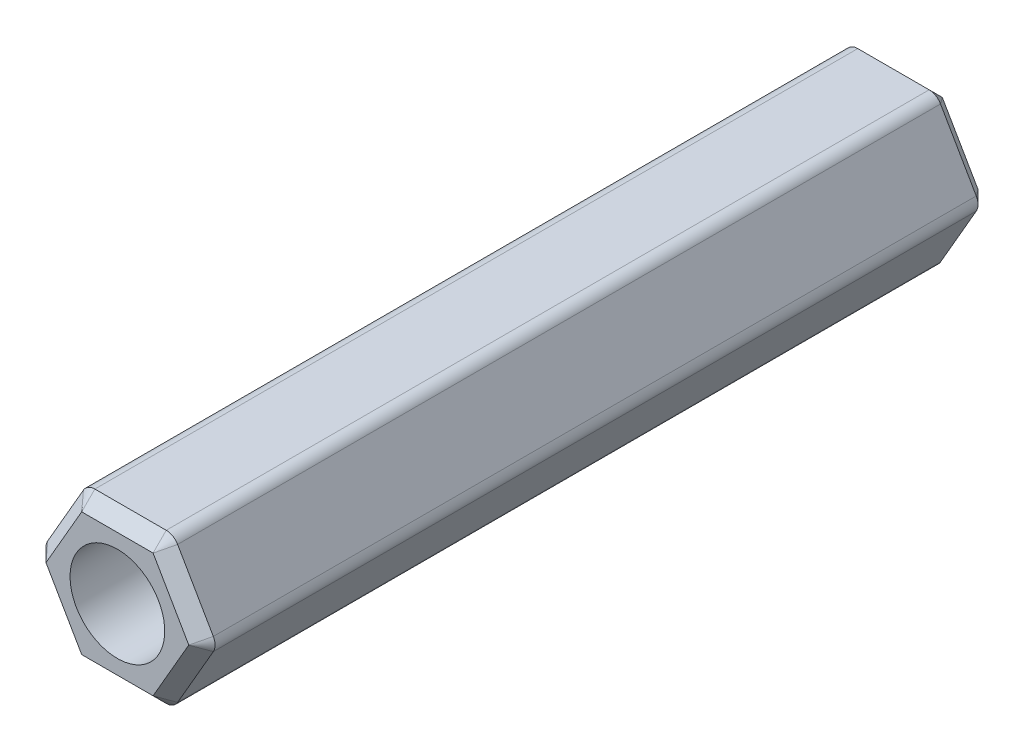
ISO-10303-21;
HEADER;
FILE_DESCRIPTION(('STEP AP214'),'2;1');
FILE_NAME('part.step','',(''),(''),'','','');
FILE_SCHEMA(('AUTOMOTIVE_DESIGN { 1 0 10303 214 1 1 1 1 }'));
ENDSEC;
DATA;
#1=APPLICATION_CONTEXT('core data for automotive mechanical design processes');
#2=APPLICATION_PROTOCOL_DEFINITION('international standard','automotive_design',2000,#1);
#3=PRODUCT_CONTEXT('',#1,'mechanical');
#4=PRODUCT('Part','Part','',(#3));
#5=PRODUCT_RELATED_PRODUCT_CATEGORY('part','',(#4));
#6=PRODUCT_DEFINITION_FORMATION('','',#4);
#7=PRODUCT_DEFINITION_CONTEXT('part definition',#1,'design');
#8=PRODUCT_DEFINITION('design','',#6,#7);
#9=PRODUCT_DEFINITION_SHAPE('','',#8);
#10=(LENGTH_UNIT() NAMED_UNIT(*) SI_UNIT(.MILLI.,.METRE.));
#11=(NAMED_UNIT(*) PLANE_ANGLE_UNIT() SI_UNIT($,.RADIAN.));
#12=(NAMED_UNIT(*) SI_UNIT($,.STERADIAN.) SOLID_ANGLE_UNIT());
#13=UNCERTAINTY_MEASURE_WITH_UNIT(LENGTH_MEASURE(1.E-05),#10,'distance_accuracy_value','');
#14=(GEOMETRIC_REPRESENTATION_CONTEXT(3) GLOBAL_UNCERTAINTY_ASSIGNED_CONTEXT((#13)) GLOBAL_UNIT_ASSIGNED_CONTEXT((#10,
#11,#12)) REPRESENTATION_CONTEXT('',''));
#15=CARTESIAN_POINT('',(0.,0.,0.));
#16=DIRECTION('',(0.,0.,1.));
#17=DIRECTION('',(1.,0.,0.));
#18=AXIS2_PLACEMENT_3D('',#15,#16,#17);
#19=CARTESIAN_POINT('',(1.3567731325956,-2.34999999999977,15.));
#20=DIRECTION('',(0.,0.,-1.));
#21=DIRECTION('',(-1.,0.,0.));
#22=AXIS2_PLACEMENT_3D('',#19,#20,#21);
#23=CYLINDRICAL_SURFACE('',#22,0.499999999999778);
#24=DIRECTION('',(0.,0.,1.));
#25=VECTOR('',#24,1.);
#26=CARTESIAN_POINT('',(1.78978583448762,-2.59999999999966,15.));
#27=LINE('',#26,#25);
#28=CARTESIAN_POINT('',(1.78978583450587,-2.60000000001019,14.5000000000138));
#29=VERTEX_POINT('',#28);
#30=CARTESIAN_POINT('',(1.78978583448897,-2.60000000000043,-14.4999999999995));
#31=VERTEX_POINT('',#30);
#32=EDGE_CURVE('E212',#29,#31,#27,.F.);
#33=ORIENTED_EDGE('',*,*,#32,.F.);
#34=CARTESIAN_POINT('',(1.3567731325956,-2.34999999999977,14.5));
#35=DIRECTION('',(0.,0.,-1.));
#36=DIRECTION('',(-1.,0.,0.));
#37=AXIS2_PLACEMENT_3D('',#34,#35,#36);
#38=CIRCLE('',#37,0.499999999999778);
#39=CARTESIAN_POINT('',(1.3567731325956,-2.85000000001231,14.5000000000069));
#40=VERTEX_POINT('',#39);
#41=EDGE_CURVE('E223',#29,#40,#38,.T.);
#42=ORIENTED_EDGE('',*,*,#41,.T.);
#43=DIRECTION('',(0.,0.,-1.));
#44=VECTOR('',#43,1.);
#45=CARTESIAN_POINT('',(1.3567731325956,-2.84999999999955,15.));
#46=LINE('',#45,#44);
#47=CARTESIAN_POINT('',(1.3567731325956,-2.85000000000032,-14.4999999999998));
#48=VERTEX_POINT('',#47);
#49=EDGE_CURVE('E205',#48,#40,#46,.F.);
#50=ORIENTED_EDGE('',*,*,#49,.F.);
#51=CARTESIAN_POINT('',(1.3567731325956,-2.34999999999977,-14.4999999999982));
#52=DIRECTION('',(0.,0.,1.));
#53=DIRECTION('',(1.,0.,0.));
#54=AXIS2_PLACEMENT_3D('',#51,#52,#53);
#55=CIRCLE('',#54,0.500000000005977);
#56=EDGE_CURVE('E214',#31,#48,#55,.F.);
#57=ORIENTED_EDGE('',*,*,#56,.F.);
#58=EDGE_LOOP('',(#33,#42,#50,#57));
#59=FACE_BOUND('',#58,.T.);
#60=ADVANCED_FACE('F18',(#59),#23,.T.);
#61=CARTESIAN_POINT('',(-1.3567731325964,-2.34999999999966,15.));
#62=DIRECTION('',(0.,0.,-1.));
#63=DIRECTION('',(-1.,0.,0.));
#64=AXIS2_PLACEMENT_3D('',#61,#62,#63);
#65=CYLINDRICAL_SURFACE('',#64,0.499999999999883);
#66=DIRECTION('',(0.,0.,-1.));
#67=VECTOR('',#66,1.);
#68=CARTESIAN_POINT('',(-1.3567731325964,-2.84999999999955,15.));
#69=LINE('',#68,#67);
#70=CARTESIAN_POINT('',(-1.35677313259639,-2.84999999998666,14.5000000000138));
#71=VERTEX_POINT('',#70);
#72=CARTESIAN_POINT('',(-1.3567731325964,-2.85000000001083,-14.4999999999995));
#73=VERTEX_POINT('',#72);
#74=EDGE_CURVE('E208',#71,#73,#69,.T.);
#75=ORIENTED_EDGE('',*,*,#74,.F.);
#76=CARTESIAN_POINT('',(-1.3567731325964,-2.34999999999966,14.500000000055));
#77=DIRECTION('',(0.,0.,-1.));
#78=DIRECTION('',(-1.,0.,0.));
#79=AXIS2_PLACEMENT_3D('',#76,#77,#78);
#80=CIRCLE('',#79,0.499999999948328);
#81=CARTESIAN_POINT('',(-1.78978583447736,-2.59999999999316,14.5000000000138));
#82=VERTEX_POINT('',#81);
#83=EDGE_CURVE('E168',#82,#71,#80,.F.);
#84=ORIENTED_EDGE('',*,*,#83,.F.);
#85=DIRECTION('',(0.,0.,1.));
#86=VECTOR('',#85,1.);
#87=CARTESIAN_POINT('',(-1.78978583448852,-2.5999999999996,15.));
#88=LINE('',#87,#86);
#89=CARTESIAN_POINT('',(-1.78978583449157,-2.60000000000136,-14.4999999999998));
#90=VERTEX_POINT('',#89);
#91=EDGE_CURVE('E167',#90,#82,#88,.T.);
#92=ORIENTED_EDGE('',*,*,#91,.F.);
#93=CARTESIAN_POINT('',(-1.3567731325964,-2.34999999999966,-14.4999999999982));
#94=DIRECTION('',(0.,0.,1.));
#95=DIRECTION('',(1.,0.,0.));
#96=AXIS2_PLACEMENT_3D('',#93,#94,#95);
#97=CIRCLE('',#96,0.500000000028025);
#98=EDGE_CURVE('E140',#73,#90,#97,.F.);
#99=ORIENTED_EDGE('',*,*,#98,.F.);
#100=EDGE_LOOP('',(#75,#84,#92,#99));
#101=FACE_BOUND('',#100,.T.);
#102=ADVANCED_FACE('F720',(#101),#65,.T.);
#103=CARTESIAN_POINT('',(-2.71354626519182,1.01649243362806E-13,15.));
#104=DIRECTION('',(0.,0.,-1.));
#105=DIRECTION('',(-1.,0.,0.));
#106=AXIS2_PLACEMENT_3D('',#103,#104,#105);
#107=CYLINDRICAL_SURFACE('',#106,0.499999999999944);
#108=DIRECTION('',(0.,0.,1.));
#109=VECTOR('',#108,1.);
#110=CARTESIAN_POINT('',(-3.14655896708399,0.250000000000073,15.));
#111=LINE('',#110,#109);
#112=CARTESIAN_POINT('',(-3.14655896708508,0.250000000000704,-14.4999999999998));
#113=VERTEX_POINT('',#112);
#114=CARTESIAN_POINT('',(-3.14655896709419,0.249999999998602,14.5000000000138));
#115=VERTEX_POINT('',#114);
#116=EDGE_CURVE('E152',#113,#115,#111,.T.);
#117=ORIENTED_EDGE('',*,*,#116,.F.);
#118=CARTESIAN_POINT('',(-2.71354626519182,1.01649243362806E-13,-14.4999999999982));
#119=DIRECTION('',(0.,0.,1.));
#120=DIRECTION('',(1.,0.,0.));
#121=AXIS2_PLACEMENT_3D('',#118,#119,#120);
#122=CIRCLE('',#121,0.500000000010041);
#123=CARTESIAN_POINT('',(-3.1465589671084,-0.249999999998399,-14.4999999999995));
#124=VERTEX_POINT('',#123);
#125=EDGE_CURVE('E146',#124,#113,#122,.F.);
#126=ORIENTED_EDGE('',*,*,#125,.F.);
#127=DIRECTION('',(0.,0.,1.));
#128=VECTOR('',#127,1.);
#129=CARTESIAN_POINT('',(-3.14655896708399,-0.24999999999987,15.));
#130=LINE('',#129,#128);
#131=CARTESIAN_POINT('',(-3.14655896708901,-0.250000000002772,14.5000000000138));
#132=VERTEX_POINT('',#131);
#133=EDGE_CURVE('E150',#132,#124,#130,.F.);
#134=ORIENTED_EDGE('',*,*,#133,.F.);
#135=CARTESIAN_POINT('',(-2.71354626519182,1.01649243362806E-13,14.500000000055));
#136=DIRECTION('',(0.,0.,-1.));
#137=DIRECTION('',(-1.,0.,0.));
#138=AXIS2_PLACEMENT_3D('',#135,#136,#137);
#139=CIRCLE('',#138,0.500000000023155);
#140=EDGE_CURVE('E201',#115,#132,#139,.F.);
#141=ORIENTED_EDGE('',*,*,#140,.F.);
#142=EDGE_LOOP('',(#117,#126,#134,#141));
#143=FACE_BOUND('',#142,.T.);
#144=ADVANCED_FACE('F148',(#143),#107,.T.);
#145=CARTESIAN_POINT('',(-1.35677313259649,2.34999999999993,15.));
#146=DIRECTION('',(0.,0.,-1.));
#147=DIRECTION('',(-1.,0.,0.));
#148=AXIS2_PLACEMENT_3D('',#145,#146,#147);
#149=CYLINDRICAL_SURFACE('',#148,0.499999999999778);
#150=DIRECTION('',(0.,0.,1.));
#151=VECTOR('',#150,1.);
#152=CARTESIAN_POINT('',(-1.78978583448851,2.59999999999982,15.));
#153=LINE('',#152,#151);
#154=CARTESIAN_POINT('',(-1.78978583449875,2.60000000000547,14.4999999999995));
#155=VERTEX_POINT('',#154);
#156=CARTESIAN_POINT('',(-1.78978583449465,2.60000000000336,-14.4999999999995));
#157=VERTEX_POINT('',#156);
#158=EDGE_CURVE('E199',#155,#157,#153,.F.);
#159=ORIENTED_EDGE('',*,*,#158,.F.);
#160=CARTESIAN_POINT('',(-1.35677313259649,2.34999999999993,14.4999999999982));
#161=DIRECTION('',(0.,0.,-1.));
#162=DIRECTION('',(-1.,0.,0.));
#163=AXIS2_PLACEMENT_3D('',#160,#161,#162);
#164=CIRCLE('',#163,0.50000000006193);
#165=CARTESIAN_POINT('',(-1.35677313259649,2.85000000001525,14.4999999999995));
#166=VERTEX_POINT('',#165);
#167=EDGE_CURVE('E196',#166,#155,#164,.F.);
#168=ORIENTED_EDGE('',*,*,#167,.F.);
#169=DIRECTION('',(0.,0.,1.));
#170=VECTOR('',#169,1.);
#171=CARTESIAN_POINT('',(-1.35677313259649,2.84999999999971,15.));
#172=LINE('',#171,#170);
#173=CARTESIAN_POINT('',(-1.35677313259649,2.85000000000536,-14.4999999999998));
#174=VERTEX_POINT('',#173);
#175=EDGE_CURVE('E192',#174,#166,#172,.T.);
#176=ORIENTED_EDGE('',*,*,#175,.F.);
#177=CARTESIAN_POINT('',(-1.35677313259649,2.34999999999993,-14.4999999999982));
#178=DIRECTION('',(0.,0.,1.));
#179=DIRECTION('',(1.,0.,0.));
#180=AXIS2_PLACEMENT_3D('',#177,#178,#179);
#181=CIRCLE('',#180,0.50000000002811);
#182=EDGE_CURVE('E157',#157,#174,#181,.F.);
#183=ORIENTED_EDGE('',*,*,#182,.F.);
#184=EDGE_LOOP('',(#159,#168,#176,#183));
#185=FACE_BOUND('',#184,.T.);
#186=ADVANCED_FACE('F703',(#185),#149,.T.);
#187=CARTESIAN_POINT('',(2.71354626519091,0.,15.));
#188=DIRECTION('',(0.,0.,-1.));
#189=DIRECTION('',(-1.,0.,0.));
#190=AXIS2_PLACEMENT_3D('',#187,#188,#189);
#191=CYLINDRICAL_SURFACE('',#190,0.499999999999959);
#192=DIRECTION('',(0.,0.,1.));
#193=VECTOR('',#192,1.);
#194=CARTESIAN_POINT('',(3.14655896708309,0.250000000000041,15.));
#195=LINE('',#194,#193);
#196=CARTESIAN_POINT('',(3.14655896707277,0.249999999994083,14.5000000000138));
#197=VERTEX_POINT('',#196);
#198=CARTESIAN_POINT('',(3.1465589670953,0.250000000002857,-14.4999999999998));
#199=VERTEX_POINT('',#198);
#200=EDGE_CURVE('E184',#197,#199,#195,.F.);
#201=ORIENTED_EDGE('',*,*,#200,.F.);
#202=CARTESIAN_POINT('',(2.71354626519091,0.,14.500000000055));
#203=DIRECTION('',(0.,0.,-1.));
#204=DIRECTION('',(-1.,0.,0.));
#205=AXIS2_PLACEMENT_3D('',#202,#203,#204);
#206=CIRCLE('',#205,0.499999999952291);
#207=CARTESIAN_POINT('',(3.14655896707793,-0.249999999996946,14.5000000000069));
#208=VERTEX_POINT('',#207);
#209=EDGE_CURVE('E190',#208,#197,#206,.F.);
#210=ORIENTED_EDGE('',*,*,#209,.F.);
#211=DIRECTION('',(0.,0.,1.));
#212=VECTOR('',#211,1.);
#213=CARTESIAN_POINT('',(3.14655896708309,-0.249999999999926,15.));
#214=LINE('',#213,#212);
#215=CARTESIAN_POINT('',(3.14655896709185,-0.250000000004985,-14.4999999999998));
#216=VERTEX_POINT('',#215);
#217=EDGE_CURVE('E210',#216,#208,#214,.T.);
#218=ORIENTED_EDGE('',*,*,#217,.F.);
#219=CARTESIAN_POINT('',(2.71354626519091,0.,-14.4999999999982));
#220=DIRECTION('',(0.,0.,1.));
#221=DIRECTION('',(1.,0.,0.));
#222=AXIS2_PLACEMENT_3D('',#219,#220,#221);
#223=CIRCLE('',#222,0.500000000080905);
#224=EDGE_CURVE('E217',#199,#216,#223,.F.);
#225=ORIENTED_EDGE('',*,*,#224,.F.);
#226=EDGE_LOOP('',(#201,#210,#218,#225));
#227=FACE_BOUND('',#226,.T.);
#228=ADVANCED_FACE('F694',(#227),#191,.T.);
#229=CARTESIAN_POINT('',(1.35677313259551,2.34999999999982,15.));
#230=DIRECTION('',(0.,0.,-1.));
#231=DIRECTION('',(-1.,0.,0.));
#232=AXIS2_PLACEMENT_3D('',#229,#230,#231);
#233=CYLINDRICAL_SURFACE('',#232,0.499999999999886);
#234=DIRECTION('',(0.,0.,1.));
#235=VECTOR('',#234,1.);
#236=CARTESIAN_POINT('',(1.35677313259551,2.84999999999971,15.));
#237=LINE('',#236,#235);
#238=CARTESIAN_POINT('',(1.3567731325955,2.85000000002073,14.5000000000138));
#239=VERTEX_POINT('',#238);
#240=CARTESIAN_POINT('',(1.35677313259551,2.85000000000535,-14.4999999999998));
#241=VERTEX_POINT('',#240);
#242=EDGE_CURVE('E194',#239,#241,#237,.F.);
#243=ORIENTED_EDGE('',*,*,#242,.F.);
#244=CARTESIAN_POINT('',(1.35677313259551,2.34999999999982,14.5));
#245=DIRECTION('',(0.,0.,-1.));
#246=DIRECTION('',(-1.,0.,0.));
#247=AXIS2_PLACEMENT_3D('',#244,#245,#246);
#248=CIRCLE('',#247,0.499999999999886);
#249=CARTESIAN_POINT('',(1.78978583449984,2.60000000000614,14.5000000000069));
#250=VERTEX_POINT('',#249);
#251=EDGE_CURVE('E158',#239,#250,#248,.T.);
#252=ORIENTED_EDGE('',*,*,#251,.T.);
#253=DIRECTION('',(0.,0.,1.));
#254=VECTOR('',#253,1.);
#255=CARTESIAN_POINT('',(1.78978583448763,2.59999999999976,15.));
#256=LINE('',#255,#254);
#257=CARTESIAN_POINT('',(1.7897858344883,2.60000000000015,-14.4999999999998));
#258=VERTEX_POINT('',#257);
#259=EDGE_CURVE('E181',#258,#250,#256,.T.);
#260=ORIENTED_EDGE('',*,*,#259,.F.);
#261=CARTESIAN_POINT('',(1.35677313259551,2.34999999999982,-14.4999999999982));
#262=DIRECTION('',(0.,0.,1.));
#263=DIRECTION('',(1.,0.,0.));
#264=AXIS2_PLACEMENT_3D('',#261,#262,#263);
#265=CIRCLE('',#264,0.500000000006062);
#266=EDGE_CURVE('E219',#241,#258,#265,.F.);
#267=ORIENTED_EDGE('',*,*,#266,.F.);
#268=EDGE_LOOP('',(#243,#252,#260,#267));
#269=FACE_BOUND('',#268,.T.);
#270=ADVANCED_FACE('F686',(#269),#233,.T.);
#271=CARTESIAN_POINT('',(-2.71354626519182,1.01649243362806E-13,-14.4999999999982));
#272=DIRECTION('',(0.,0.,1.));
#273=DIRECTION('',(0.,-1.,0.));
#274=AXIS2_PLACEMENT_3D('',#271,#272,#273);
#275=CONICAL_SURFACE('',#274,0.500000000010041,0.785398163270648);
#276=ORIENTED_EDGE('',*,*,#125,.T.);
#277=DIRECTION('',(0.612372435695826,-0.353553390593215,-0.707106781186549));
#278=VECTOR('',#277,1.);
#279=CARTESIAN_POINT('',(-3.14655896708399,0.250000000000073,-14.5));
#280=LINE('',#279,#278);
#281=CARTESIAN_POINT('',(-2.71354626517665,8.85888607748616E-12,-15.00000000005));
#282=VERTEX_POINT('',#281);
#283=EDGE_CURVE('E179',#113,#282,#280,.T.);
#284=ORIENTED_EDGE('',*,*,#283,.T.);
#285=DIRECTION('',(-0.612372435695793,-0.353553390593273,0.707106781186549));
#286=VECTOR('',#285,1.);
#287=CARTESIAN_POINT('',(-2.71354626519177,1.28586377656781E-13,-15.));
#288=LINE('',#287,#286);
#289=EDGE_CURVE('E174',#282,#124,#288,.T.);
#290=ORIENTED_EDGE('',*,*,#289,.T.);
#291=EDGE_LOOP('',(#276,#284,#290));
#292=FACE_BOUND('',#291,.T.);
#293=ADVANCED_FACE('F178',(#292),#275,.T.);
#294=CARTESIAN_POINT('',(-1.35677313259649,2.34999999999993,-14.4999999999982));
#295=DIRECTION('',(0.,0.,1.));
#296=DIRECTION('',(0.,-1.,0.));
#297=AXIS2_PLACEMENT_3D('',#294,#295,#296);
#298=CONICAL_SURFACE('',#297,0.50000000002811,0.785398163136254);
#299=DIRECTION('',(0.,-0.707106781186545,-0.70710678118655));
#300=VECTOR('',#299,1.);
#301=CARTESIAN_POINT('',(-1.35677313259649,2.34999999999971,-15.));
#302=LINE('',#301,#300);
#303=CARTESIAN_POINT('',(-1.35677313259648,2.34999999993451,-15.0000000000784));
#304=VERTEX_POINT('',#303);
#305=EDGE_CURVE('E294',#174,#304,#302,.T.);
#306=ORIENTED_EDGE('',*,*,#305,.T.);
#307=DIRECTION('',(-0.612372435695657,0.353553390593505,0.707106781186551));
#308=VECTOR('',#307,1.);
#309=CARTESIAN_POINT('',(-1.35677313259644,2.34999999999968,-14.9999999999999));
#310=LINE('',#309,#308);
#311=EDGE_CURVE('E304',#304,#157,#310,.T.);
#312=ORIENTED_EDGE('',*,*,#311,.T.);
#313=ORIENTED_EDGE('',*,*,#182,.T.);
#314=EDGE_LOOP('',(#306,#312,#313));
#315=FACE_BOUND('',#314,.T.);
#316=ADVANCED_FACE('F670',(#315),#298,.T.);
#317=CARTESIAN_POINT('',(1.35677313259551,2.34999999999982,-14.4999999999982));
#318=DIRECTION('',(0.,0.,1.));
#319=DIRECTION('',(0.,-1.,0.));
#320=AXIS2_PLACEMENT_3D('',#317,#318,#319);
#321=CONICAL_SURFACE('',#320,0.500000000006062,0.785398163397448);
#322=DIRECTION('',(-0.612372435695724,-0.35355339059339,-0.70710678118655));
#323=VECTOR('',#322,1.);
#324=CARTESIAN_POINT('',(1.78978583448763,2.59999999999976,-14.5));
#325=LINE('',#324,#323);
#326=CARTESIAN_POINT('',(1.35677313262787,2.35000000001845,-14.9999999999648));
#327=VERTEX_POINT('',#326);
#328=EDGE_CURVE('E285',#258,#327,#325,.T.);
#329=ORIENTED_EDGE('',*,*,#328,.T.);
#330=DIRECTION('',(0.,-0.707106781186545,-0.70710678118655));
#331=VECTOR('',#330,1.);
#332=CARTESIAN_POINT('',(1.35677313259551,2.34999999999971,-15.));
#333=LINE('',#332,#331);
#334=EDGE_CURVE('E291',#327,#241,#333,.F.);
#335=ORIENTED_EDGE('',*,*,#334,.T.);
#336=ORIENTED_EDGE('',*,*,#266,.T.);
#337=EDGE_LOOP('',(#329,#335,#336));
#338=FACE_BOUND('',#337,.T.);
#339=ADVANCED_FACE('F389',(#338),#321,.T.);
#340=CARTESIAN_POINT('',(2.71354626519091,0.,-14.4999999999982));
#341=DIRECTION('',(0.,0.,1.));
#342=DIRECTION('',(0.,-1.,0.));
#343=AXIS2_PLACEMENT_3D('',#340,#341,#342);
#344=CONICAL_SURFACE('',#343,0.500000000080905,0.785398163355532);
#345=DIRECTION('',(-0.61237243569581,0.353553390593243,-0.70710678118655));
#346=VECTOR('',#345,1.);
#347=CARTESIAN_POINT('',(3.14655896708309,-0.249999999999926,-14.5));
#348=LINE('',#347,#346);
#349=CARTESIAN_POINT('',(2.71354626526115,1.68725733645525E-11,-14.9999999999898));
#350=VERTEX_POINT('',#349);
#351=EDGE_CURVE('E273',#216,#350,#348,.T.);
#352=ORIENTED_EDGE('',*,*,#351,.T.);
#353=DIRECTION('',(0.612372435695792,0.353553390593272,0.70710678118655));
#354=VECTOR('',#353,1.);
#355=CARTESIAN_POINT('',(2.71354626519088,0.,-15.));
#356=LINE('',#355,#354);
#357=EDGE_CURVE('E282',#350,#199,#356,.T.);
#358=ORIENTED_EDGE('',*,*,#357,.T.);
#359=ORIENTED_EDGE('',*,*,#224,.T.);
#360=EDGE_LOOP('',(#352,#358,#359));
#361=FACE_BOUND('',#360,.T.);
#362=ADVANCED_FACE('F396',(#361),#344,.T.);
#363=CARTESIAN_POINT('',(-1.3567731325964,-2.34999999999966,-14.4999999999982));
#364=DIRECTION('',(0.,0.,1.));
#365=DIRECTION('',(0.,-1.,0.));
#366=AXIS2_PLACEMENT_3D('',#363,#364,#365);
#367=CONICAL_SURFACE('',#366,0.500000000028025,0.785398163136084);
#368=ORIENTED_EDGE('',*,*,#98,.T.);
#369=DIRECTION('',(0.612372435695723,0.353553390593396,-0.707106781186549));
#370=VECTOR('',#369,1.);
#371=CARTESIAN_POINT('',(-1.78978583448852,-2.59999999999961,-14.5));
#372=LINE('',#371,#370);
#373=CARTESIAN_POINT('',(-1.35677313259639,-2.34999999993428,-15.0000000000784));
#374=VERTEX_POINT('',#373);
#375=EDGE_CURVE('E176',#90,#374,#372,.T.);
#376=ORIENTED_EDGE('',*,*,#375,.T.);
#377=DIRECTION('',(0.,-0.707106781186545,0.70710678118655));
#378=VECTOR('',#377,1.);
#379=CARTESIAN_POINT('',(-1.3567731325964,-2.34999999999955,-15.));
#380=LINE('',#379,#378);
#381=EDGE_CURVE('E271',#374,#73,#380,.T.);
#382=ORIENTED_EDGE('',*,*,#381,.T.);
#383=EDGE_LOOP('',(#368,#376,#382));
#384=FACE_BOUND('',#383,.T.);
#385=ADVANCED_FACE('F307',(#384),#367,.T.);
#386=CARTESIAN_POINT('',(1.3567731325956,-2.34999999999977,-14.5000000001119));
#387=DIRECTION('',(0.,0.,1.));
#388=DIRECTION('',(1.,0.,0.));
#389=AXIS2_PLACEMENT_3D('',#386,#387,#388);
#390=CONICAL_SURFACE('',#389,0.499999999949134,0.785398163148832);
#391=ORIENTED_EDGE('',*,*,#56,.T.);
#392=DIRECTION('',(0.,-0.707106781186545,0.70710678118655));
#393=VECTOR('',#392,1.);
#394=CARTESIAN_POINT('',(1.3567731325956,-2.34999999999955,-15.));
#395=LINE('',#394,#393);
#396=CARTESIAN_POINT('',(1.35677313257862,-2.34999999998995,-15.00000000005));
#397=VERTEX_POINT('',#396);
#398=EDGE_CURVE('E267',#48,#397,#395,.F.);
#399=ORIENTED_EDGE('',*,*,#398,.T.);
#400=DIRECTION('',(0.612372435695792,-0.353553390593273,0.70710678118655));
#401=VECTOR('',#400,1.);
#402=CARTESIAN_POINT('',(1.35677313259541,-2.34999999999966,-15.));
#403=LINE('',#402,#401);
#404=EDGE_CURVE('E279',#397,#31,#403,.T.);
#405=ORIENTED_EDGE('',*,*,#404,.T.);
#406=EDGE_LOOP('',(#391,#399,#405));
#407=FACE_BOUND('',#406,.T.);
#408=ADVANCED_FACE('F403',(#407),#390,.T.);
#409=CARTESIAN_POINT('',(3.14655896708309,-0.249999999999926,15.));
#410=DIRECTION('',(0.866025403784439,-0.5,0.));
#411=DIRECTION('',(0.5,0.866025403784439,0.));
#412=AXIS2_PLACEMENT_3D('',#409,#410,#411);
#413=PLANE('',#412);
#414=ORIENTED_EDGE('',*,*,#217,.T.);
#415=DIRECTION('',(0.5,0.866025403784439,0.));
#416=VECTOR('',#415,1.);
#417=CARTESIAN_POINT('',(1.78978583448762,-2.59999999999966,14.5));
#418=LINE('',#417,#416);
#419=EDGE_CURVE('E263',#29,#208,#418,.T.);
#420=ORIENTED_EDGE('',*,*,#419,.F.);
#421=ORIENTED_EDGE('',*,*,#32,.T.);
#422=DIRECTION('',(0.5,0.866025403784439,0.));
#423=VECTOR('',#422,1.);
#424=CARTESIAN_POINT('',(1.78978583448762,-2.59999999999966,-14.5));
#425=LINE('',#424,#423);
#426=EDGE_CURVE('E276',#31,#216,#425,.T.);
#427=ORIENTED_EDGE('',*,*,#426,.T.);
#428=EDGE_LOOP('',(#414,#420,#421,#427));
#429=FACE_BOUND('',#428,.T.);
#430=ADVANCED_FACE('F633',(#429),#413,.T.);
#431=CARTESIAN_POINT('',(1.3567731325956,-2.84999999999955,15.));
#432=DIRECTION('',(0.,-1.,0.));
#433=DIRECTION('',(0.,0.,-1.));
#434=AXIS2_PLACEMENT_3D('',#431,#432,#433);
#435=PLANE('',#434);
#436=ORIENTED_EDGE('',*,*,#49,.T.);
#437=DIRECTION('',(1.,0.,0.));
#438=VECTOR('',#437,1.);
#439=CARTESIAN_POINT('',(1.3567731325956,-2.84999999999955,14.5));
#440=LINE('',#439,#438);
#441=EDGE_CURVE('E239',#71,#40,#440,.T.);
#442=ORIENTED_EDGE('',*,*,#441,.F.);
#443=ORIENTED_EDGE('',*,*,#74,.T.);
#444=DIRECTION('',(1.,0.,0.));
#445=VECTOR('',#444,1.);
#446=CARTESIAN_POINT('',(-1.35677313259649,-2.84999999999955,-14.5));
#447=LINE('',#446,#445);
#448=EDGE_CURVE('E241',#73,#48,#447,.T.);
#449=ORIENTED_EDGE('',*,*,#448,.T.);
#450=EDGE_LOOP('',(#436,#442,#443,#449));
#451=FACE_BOUND('',#450,.T.);
#452=ADVANCED_FACE('F238',(#451),#435,.T.);
#453=CARTESIAN_POINT('',(1.3567731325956,-2.34999999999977,14.500000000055));
#454=DIRECTION('',(0.,0.,-1.));
#455=DIRECTION('',(-1.,0.,0.));
#456=AXIS2_PLACEMENT_3D('',#453,#454,#455);
#457=CONICAL_SURFACE('',#456,0.500000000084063,0.785398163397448);
#458=ORIENTED_EDGE('',*,*,#41,.F.);
#459=DIRECTION('',(0.61237243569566,-0.353553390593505,-0.707106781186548));
#460=VECTOR('',#459,1.);
#461=CARTESIAN_POINT('',(1.35677313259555,-2.34999999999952,14.9999999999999));
#462=LINE('',#461,#460);
#463=CARTESIAN_POINT('',(1.35677313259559,-2.35000000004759,15.0000000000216));
#464=VERTEX_POINT('',#463);
#465=EDGE_CURVE('E252',#464,#29,#462,.T.);
#466=ORIENTED_EDGE('',*,*,#465,.F.);
#467=DIRECTION('',(0.,-0.707106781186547,-0.707106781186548));
#468=VECTOR('',#467,1.);
#469=CARTESIAN_POINT('',(1.3567731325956,-2.84999999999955,14.5));
#470=LINE('',#469,#468);
#471=EDGE_CURVE('E246',#40,#464,#470,.F.);
#472=ORIENTED_EDGE('',*,*,#471,.F.);
#473=EDGE_LOOP('',(#458,#466,#472));
#474=FACE_BOUND('',#473,.T.);
#475=ADVANCED_FACE('F251',(#474),#457,.T.);
#476=CARTESIAN_POINT('',(-1.3567731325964,-2.34999999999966,14.5000000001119));
#477=DIRECTION('',(0.,0.,-1.));
#478=DIRECTION('',(-1.,0.,0.));
#479=AXIS2_PLACEMENT_3D('',#476,#477,#478);
#480=CONICAL_SURFACE('',#479,0.499999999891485,0.785398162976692);
#481=DIRECTION('',(0.,-0.707106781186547,-0.707106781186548));
#482=VECTOR('',#481,1.);
#483=CARTESIAN_POINT('',(-1.3567731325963,-2.84999999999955,14.5));
#484=LINE('',#483,#482);
#485=CARTESIAN_POINT('',(-1.35677313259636,-2.34999999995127,15.0000000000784));
#486=VERTEX_POINT('',#485);
#487=EDGE_CURVE('E248',#486,#71,#484,.T.);
#488=ORIENTED_EDGE('',*,*,#487,.F.);
#489=DIRECTION('',(0.612372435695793,0.353553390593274,0.707106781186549));
#490=VECTOR('',#489,1.);
#491=CARTESIAN_POINT('',(-1.78978583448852,-2.5999999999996,14.5));
#492=LINE('',#491,#490);
#493=EDGE_CURVE('E254',#82,#486,#492,.T.);
#494=ORIENTED_EDGE('',*,*,#493,.F.);
#495=ORIENTED_EDGE('',*,*,#83,.T.);
#496=EDGE_LOOP('',(#488,#494,#495));
#497=FACE_BOUND('',#496,.T.);
#498=ADVANCED_FACE('F610',(#497),#480,.T.);
#499=CARTESIAN_POINT('',(-1.78978583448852,-2.5999999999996,15.));
#500=DIRECTION('',(-0.866025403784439,-0.5,0.));
#501=DIRECTION('',(0.5,-0.866025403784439,0.));
#502=AXIS2_PLACEMENT_3D('',#499,#500,#501);
#503=PLANE('',#502);
#504=ORIENTED_EDGE('',*,*,#91,.T.);
#505=DIRECTION('',(0.5,-0.866025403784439,0.));
#506=VECTOR('',#505,1.);
#507=CARTESIAN_POINT('',(-3.14655896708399,-0.249999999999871,14.5));
#508=LINE('',#507,#506);
#509=EDGE_CURVE('E166',#132,#82,#508,.T.);
#510=ORIENTED_EDGE('',*,*,#509,.F.);
#511=ORIENTED_EDGE('',*,*,#133,.T.);
#512=DIRECTION('',(0.5,-0.866025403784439,0.));
#513=VECTOR('',#512,1.);
#514=CARTESIAN_POINT('',(-3.14655896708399,-0.249999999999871,-14.5));
#515=LINE('',#514,#513);
#516=EDGE_CURVE('E164',#124,#90,#515,.T.);
#517=ORIENTED_EDGE('',*,*,#516,.T.);
#518=EDGE_LOOP('',(#504,#510,#511,#517));
#519=FACE_BOUND('',#518,.T.);
#520=ADVANCED_FACE('F163',(#519),#503,.T.);
#521=CARTESIAN_POINT('',(-2.71354626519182,1.01649243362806E-13,14.5000000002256));
#522=DIRECTION('',(0.,0.,-1.));
#523=DIRECTION('',(-1.,0.,0.));
#524=AXIS2_PLACEMENT_3D('',#521,#522,#523);
#525=CONICAL_SURFACE('',#524,0.499999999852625,0.785398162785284);
#526=DIRECTION('',(0.612372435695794,-0.353553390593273,0.707106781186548));
#527=VECTOR('',#526,1.);
#528=CARTESIAN_POINT('',(-3.14655896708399,0.250000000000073,14.5));
#529=LINE('',#528,#527);
#530=CARTESIAN_POINT('',(-2.71354626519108,-1.55627651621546E-12,15.0000000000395));
#531=VERTEX_POINT('',#530);
#532=EDGE_CURVE('E347',#115,#531,#529,.T.);
#533=ORIENTED_EDGE('',*,*,#532,.F.);
#534=ORIENTED_EDGE('',*,*,#140,.T.);
#535=DIRECTION('',(-0.612372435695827,-0.353553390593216,-0.707106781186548));
#536=VECTOR('',#535,1.);
#537=CARTESIAN_POINT('',(-2.71354626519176,0.,15.));
#538=LINE('',#537,#536);
#539=EDGE_CURVE('E256',#531,#132,#538,.T.);
#540=ORIENTED_EDGE('',*,*,#539,.F.);
#541=EDGE_LOOP('',(#533,#534,#540));
#542=FACE_BOUND('',#541,.T.);
#543=ADVANCED_FACE('F360',(#542),#525,.T.);
#544=CARTESIAN_POINT('',(-3.14655896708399,0.250000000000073,15.));
#545=DIRECTION('',(-0.866025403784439,0.5,0.));
#546=DIRECTION('',(-0.5,-0.866025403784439,0.));
#547=AXIS2_PLACEMENT_3D('',#544,#545,#546);
#548=PLANE('',#547);
#549=ORIENTED_EDGE('',*,*,#116,.T.);
#550=DIRECTION('',(-0.5,-0.866025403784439,0.));
#551=VECTOR('',#550,1.);
#552=CARTESIAN_POINT('',(-1.78978583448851,2.59999999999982,14.5));
#553=LINE('',#552,#551);
#554=EDGE_CURVE('E341',#155,#115,#553,.T.);
#555=ORIENTED_EDGE('',*,*,#554,.F.);
#556=ORIENTED_EDGE('',*,*,#158,.T.);
#557=DIRECTION('',(-0.5,-0.866025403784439,0.));
#558=VECTOR('',#557,1.);
#559=CARTESIAN_POINT('',(-1.78978583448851,2.59999999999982,-14.5));
#560=LINE('',#559,#558);
#561=EDGE_CURVE('E301',#157,#113,#560,.T.);
#562=ORIENTED_EDGE('',*,*,#561,.T.);
#563=EDGE_LOOP('',(#549,#555,#556,#562));
#564=FACE_BOUND('',#563,.T.);
#565=ADVANCED_FACE('F586',(#564),#548,.T.);
#566=CARTESIAN_POINT('',(-1.35677313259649,2.34999999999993,14.5000000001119));
#567=DIRECTION('',(0.,0.,-1.));
#568=DIRECTION('',(-1.,0.,0.));
#569=AXIS2_PLACEMENT_3D('',#566,#567,#568);
#570=CONICAL_SURFACE('',#569,0.4999999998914,0.785398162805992);
#571=DIRECTION('',(-0.612372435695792,0.353553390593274,-0.707106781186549));
#572=VECTOR('',#571,1.);
#573=CARTESIAN_POINT('',(-1.3567731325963,2.34999999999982,15.));
#574=LINE('',#573,#572);
#575=CARTESIAN_POINT('',(-1.35677313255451,2.34999999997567,15.0000000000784));
#576=VERTEX_POINT('',#575);
#577=EDGE_CURVE('E344',#576,#155,#574,.T.);
#578=ORIENTED_EDGE('',*,*,#577,.F.);
#579=DIRECTION('',(0.,-0.707106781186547,0.707106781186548));
#580=VECTOR('',#579,1.);
#581=CARTESIAN_POINT('',(-1.35677313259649,2.84999999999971,14.5));
#582=LINE('',#581,#580);
#583=EDGE_CURVE('E339',#166,#576,#582,.T.);
#584=ORIENTED_EDGE('',*,*,#583,.F.);
#585=ORIENTED_EDGE('',*,*,#167,.T.);
#586=EDGE_LOOP('',(#578,#584,#585));
#587=FACE_BOUND('',#586,.T.);
#588=ADVANCED_FACE('F577',(#587),#570,.T.);
#589=CARTESIAN_POINT('',(-1.35677313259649,2.84999999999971,15.));
#590=DIRECTION('',(0.,1.,0.));
#591=DIRECTION('',(-1.,0.,0.));
#592=AXIS2_PLACEMENT_3D('',#589,#590,#591);
#593=PLANE('',#592);
#594=ORIENTED_EDGE('',*,*,#175,.T.);
#595=DIRECTION('',(1.,0.,0.));
#596=VECTOR('',#595,1.);
#597=CARTESIAN_POINT('',(-1.35677313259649,2.84999999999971,14.5));
#598=LINE('',#597,#596);
#599=EDGE_CURVE('E333',#239,#166,#598,.F.);
#600=ORIENTED_EDGE('',*,*,#599,.F.);
#601=ORIENTED_EDGE('',*,*,#242,.T.);
#602=DIRECTION('',(1.,0.,0.));
#603=VECTOR('',#602,1.);
#604=CARTESIAN_POINT('',(-1.35677313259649,2.84999999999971,-14.5));
#605=LINE('',#604,#603);
#606=EDGE_CURVE('E297',#241,#174,#605,.F.);
#607=ORIENTED_EDGE('',*,*,#606,.T.);
#608=EDGE_LOOP('',(#594,#600,#601,#607));
#609=FACE_BOUND('',#608,.T.);
#610=ADVANCED_FACE('F568',(#609),#593,.T.);
#611=CARTESIAN_POINT('',(2.71354626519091,0.,14.5000000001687));
#612=DIRECTION('',(0.,0.,-1.));
#613=DIRECTION('',(0.,1.,0.));
#614=AXIS2_PLACEMENT_3D('',#611,#612,#613);
#615=CONICAL_SURFACE('',#614,0.499999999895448,0.78539816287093);
#616=ORIENTED_EDGE('',*,*,#209,.T.);
#617=DIRECTION('',(0.612372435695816,0.353553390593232,-0.707106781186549));
#618=VECTOR('',#617,1.);
#619=CARTESIAN_POINT('',(2.71354626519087,0.,15.));
#620=LINE('',#619,#618);
#621=CARTESIAN_POINT('',(2.71354626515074,2.32528946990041E-11,15.0000000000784));
#622=VERTEX_POINT('',#621);
#623=EDGE_CURVE('E330',#622,#197,#620,.T.);
#624=ORIENTED_EDGE('',*,*,#623,.F.);
#625=DIRECTION('',(-0.612372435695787,0.353553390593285,0.707106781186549));
#626=VECTOR('',#625,1.);
#627=CARTESIAN_POINT('',(3.14655896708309,-0.249999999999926,14.5));
#628=LINE('',#627,#626);
#629=EDGE_CURVE('E261',#208,#622,#628,.T.);
#630=ORIENTED_EDGE('',*,*,#629,.F.);
#631=EDGE_LOOP('',(#616,#624,#630));
#632=FACE_BOUND('',#631,.T.);
#633=ADVANCED_FACE('F559',(#632),#615,.T.);
#634=CARTESIAN_POINT('',(1.78978583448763,2.59999999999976,15.));
#635=DIRECTION('',(0.866025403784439,0.5,0.));
#636=DIRECTION('',(-0.5,0.866025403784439,0.));
#637=AXIS2_PLACEMENT_3D('',#634,#635,#636);
#638=PLANE('',#637);
#639=ORIENTED_EDGE('',*,*,#259,.T.);
#640=DIRECTION('',(-0.5,0.866025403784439,0.));
#641=VECTOR('',#640,1.);
#642=CARTESIAN_POINT('',(3.14655896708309,0.250000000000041,14.5));
#643=LINE('',#642,#641);
#644=EDGE_CURVE('E325',#197,#250,#643,.T.);
#645=ORIENTED_EDGE('',*,*,#644,.F.);
#646=ORIENTED_EDGE('',*,*,#200,.T.);
#647=DIRECTION('',(-0.5,0.866025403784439,0.));
#648=VECTOR('',#647,1.);
#649=CARTESIAN_POINT('',(3.14655896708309,0.250000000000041,-14.5));
#650=LINE('',#649,#648);
#651=EDGE_CURVE('E288',#199,#258,#650,.T.);
#652=ORIENTED_EDGE('',*,*,#651,.T.);
#653=EDGE_LOOP('',(#639,#645,#646,#652));
#654=FACE_BOUND('',#653,.T.);
#655=ADVANCED_FACE('F550',(#654),#638,.T.);
#656=CARTESIAN_POINT('',(1.35677313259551,2.34999999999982,14.500000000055));
#657=DIRECTION('',(0.,0.,-1.));
#658=DIRECTION('',(-1.,0.,0.));
#659=AXIS2_PLACEMENT_3D('',#656,#657,#658);
#660=CONICAL_SURFACE('',#659,0.500000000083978,0.785398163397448);
#661=ORIENTED_EDGE('',*,*,#251,.F.);
#662=DIRECTION('',(0.,-0.707106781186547,0.707106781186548));
#663=VECTOR('',#662,1.);
#664=CARTESIAN_POINT('',(1.35677313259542,2.84999999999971,14.5));
#665=LINE('',#664,#663);
#666=CARTESIAN_POINT('',(1.35677313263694,2.35000000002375,15.0000000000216));
#667=VERTEX_POINT('',#666);
#668=EDGE_CURVE('E336',#667,#239,#665,.F.);
#669=ORIENTED_EDGE('',*,*,#668,.F.);
#670=DIRECTION('',(-0.612372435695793,-0.353553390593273,0.707106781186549));
#671=VECTOR('',#670,1.);
#672=CARTESIAN_POINT('',(1.78978583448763,2.59999999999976,14.5));
#673=LINE('',#672,#671);
#674=EDGE_CURVE('E34',#250,#667,#673,.T.);
#675=ORIENTED_EDGE('',*,*,#674,.F.);
#676=EDGE_LOOP('',(#661,#669,#675));
#677=FACE_BOUND('',#676,.T.);
#678=ADVANCED_FACE('F542',(#677),#660,.T.);
#679=CARTESIAN_POINT('',(-3.39193283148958,1.17500000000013,-15.));
#680=DIRECTION('',(0.612372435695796,0.353553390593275,0.707106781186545));
#681=DIRECTION('',(0.755928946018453,0.,-0.654653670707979));
#682=AXIS2_PLACEMENT_3D('',#679,#680,#681);
#683=PLANE('',#682);
#684=ORIENTED_EDGE('',*,*,#516,.F.);
#685=ORIENTED_EDGE('',*,*,#289,.F.);
#686=DIRECTION('',(-0.499999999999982,0.866025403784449,0.));
#687=VECTOR('',#686,1.);
#688=CARTESIAN_POINT('',(-1.3567731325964,-2.34999999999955,-15.));
#689=LINE('',#688,#687);
#690=EDGE_CURVE('E314',#374,#282,#689,.T.);
#691=ORIENTED_EDGE('',*,*,#690,.F.);
#692=ORIENTED_EDGE('',*,*,#375,.F.);
#693=EDGE_LOOP('',(#684,#685,#691,#692));
#694=FACE_BOUND('',#693,.T.);
#695=ADVANCED_FACE('F172',(#694),#683,.F.);
#696=CARTESIAN_POINT('',(-1.3567731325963,2.34999999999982,-15.));
#697=DIRECTION('',(0.612372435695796,-0.353553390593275,0.707106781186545));
#698=DIRECTION('',(0.755928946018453,0.,-0.654653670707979));
#699=AXIS2_PLACEMENT_3D('',#696,#697,#698);
#700=PLANE('',#699);
#701=ORIENTED_EDGE('',*,*,#561,.F.);
#702=ORIENTED_EDGE('',*,*,#311,.F.);
#703=DIRECTION('',(0.499999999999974,0.866025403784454,0.));
#704=VECTOR('',#703,1.);
#705=CARTESIAN_POINT('',(-2.71354626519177,1.28369537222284E-13,-15.));
#706=LINE('',#705,#704);
#707=EDGE_CURVE('E321',#282,#304,#706,.T.);
#708=ORIENTED_EDGE('',*,*,#707,.F.);
#709=ORIENTED_EDGE('',*,*,#283,.F.);
#710=EDGE_LOOP('',(#701,#702,#708,#709));
#711=FACE_BOUND('',#710,.T.);
#712=ADVANCED_FACE('F526',(#711),#700,.F.);
#713=CARTESIAN_POINT('',(-1.35677313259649,2.34999999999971,-15.));
#714=DIRECTION('',(0.,-0.70710678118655,0.707106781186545));
#715=DIRECTION('',(0.,-0.707106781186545,-0.70710678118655));
#716=AXIS2_PLACEMENT_3D('',#713,#714,#715);
#717=PLANE('',#716);
#718=DIRECTION('',(-1.,0.,0.));
#719=VECTOR('',#718,1.);
#720=CARTESIAN_POINT('',(-1.35677313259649,2.34999999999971,-15.));
#721=LINE('',#720,#719);
#722=EDGE_CURVE('E323',#304,#327,#721,.F.);
#723=ORIENTED_EDGE('',*,*,#722,.F.);
#724=ORIENTED_EDGE('',*,*,#305,.F.);
#725=ORIENTED_EDGE('',*,*,#606,.F.);
#726=ORIENTED_EDGE('',*,*,#334,.F.);
#727=EDGE_LOOP('',(#723,#724,#725,#726));
#728=FACE_BOUND('',#727,.T.);
#729=ADVANCED_FACE('F518',(#728),#717,.F.);
#730=CARTESIAN_POINT('',(0.67838656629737,3.52500000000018,-15.));
#731=DIRECTION('',(-0.612372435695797,-0.353553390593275,0.707106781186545));
#732=DIRECTION('',(0.755928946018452,0.,0.65465367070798));
#733=AXIS2_PLACEMENT_3D('',#730,#731,#732);
#734=PLANE('',#733);
#735=DIRECTION('',(0.499999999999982,-0.866025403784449,0.));
#736=VECTOR('',#735,1.);
#737=CARTESIAN_POINT('',(1.35677313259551,2.34999999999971,-15.));
#738=LINE('',#737,#736);
#739=EDGE_CURVE('E381',#327,#350,#738,.T.);
#740=ORIENTED_EDGE('',*,*,#739,.F.);
#741=ORIENTED_EDGE('',*,*,#328,.F.);
#742=ORIENTED_EDGE('',*,*,#651,.F.);
#743=ORIENTED_EDGE('',*,*,#357,.F.);
#744=EDGE_LOOP('',(#740,#741,#742,#743));
#745=FACE_BOUND('',#744,.T.);
#746=ADVANCED_FACE('F394',(#745),#734,.F.);
#747=CARTESIAN_POINT('',(2.71354626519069,-2.50667542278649E-13,-15.));
#748=DIRECTION('',(-0.612372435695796,0.353553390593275,0.707106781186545));
#749=DIRECTION('',(0.755928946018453,0.,0.654653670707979));
#750=AXIS2_PLACEMENT_3D('',#747,#748,#749);
#751=PLANE('',#750);
#752=ORIENTED_EDGE('',*,*,#426,.F.);
#753=ORIENTED_EDGE('',*,*,#404,.F.);
#754=DIRECTION('',(-0.500000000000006,-0.866025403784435,0.));
#755=VECTOR('',#754,1.);
#756=CARTESIAN_POINT('',(2.71354626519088,0.,-15.));
#757=LINE('',#756,#755);
#758=EDGE_CURVE('E317',#350,#397,#757,.T.);
#759=ORIENTED_EDGE('',*,*,#758,.F.);
#760=ORIENTED_EDGE('',*,*,#351,.F.);
#761=EDGE_LOOP('',(#752,#753,#759,#760));
#762=FACE_BOUND('',#761,.T.);
#763=ADVANCED_FACE('F401',(#762),#751,.F.);
#764=CARTESIAN_POINT('',(-1.35677313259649,-2.34999999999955,-15.));
#765=DIRECTION('',(0.,0.70710678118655,0.707106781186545));
#766=DIRECTION('',(0.,-0.707106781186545,0.70710678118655));
#767=AXIS2_PLACEMENT_3D('',#764,#765,#766);
#768=PLANE('',#767);
#769=ORIENTED_EDGE('',*,*,#448,.F.);
#770=ORIENTED_EDGE('',*,*,#381,.F.);
#771=DIRECTION('',(-1.,0.,0.));
#772=VECTOR('',#771,1.);
#773=CARTESIAN_POINT('',(-1.35677313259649,-2.34999999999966,-15.));
#774=LINE('',#773,#772);
#775=EDGE_CURVE('E311',#397,#374,#774,.T.);
#776=ORIENTED_EDGE('',*,*,#775,.F.);
#777=ORIENTED_EDGE('',*,*,#398,.F.);
#778=EDGE_LOOP('',(#769,#770,#776,#777));
#779=FACE_BOUND('',#778,.T.);
#780=ADVANCED_FACE('F404',(#779),#768,.F.);
#781=CARTESIAN_POINT('',(3.14655896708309,-0.249999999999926,14.5));
#782=DIRECTION('',(0.612372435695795,-0.353553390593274,0.707106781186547));
#783=DIRECTION('',(0.755928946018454,0.,-0.654653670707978));
#784=AXIS2_PLACEMENT_3D('',#781,#782,#783);
#785=PLANE('',#784);
#786=ORIENTED_EDGE('',*,*,#629,.T.);
#787=DIRECTION('',(-0.499999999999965,-0.866025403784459,0.));
#788=VECTOR('',#787,1.);
#789=CARTESIAN_POINT('',(2.71354626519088,0.,15.));
#790=LINE('',#789,#788);
#791=EDGE_CURVE('E319',#622,#464,#790,.T.);
#792=ORIENTED_EDGE('',*,*,#791,.T.);
#793=ORIENTED_EDGE('',*,*,#465,.T.);
#794=ORIENTED_EDGE('',*,*,#419,.T.);
#795=EDGE_LOOP('',(#786,#792,#793,#794));
#796=FACE_BOUND('',#795,.T.);
#797=ADVANCED_FACE('F406',(#796),#785,.T.);
#798=CARTESIAN_POINT('',(1.3567731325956,-2.84999999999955,14.5));
#799=DIRECTION('',(0.,-0.707106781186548,0.707106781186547));
#800=DIRECTION('',(0.,-0.707106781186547,-0.707106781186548));
#801=AXIS2_PLACEMENT_3D('',#798,#799,#800);
#802=PLANE('',#801);
#803=ORIENTED_EDGE('',*,*,#471,.T.);
#804=DIRECTION('',(-1.,0.,0.));
#805=VECTOR('',#804,1.);
#806=CARTESIAN_POINT('',(-1.35677313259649,-2.34999999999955,15.));
#807=LINE('',#806,#805);
#808=EDGE_CURVE('E373',#464,#486,#807,.T.);
#809=ORIENTED_EDGE('',*,*,#808,.T.);
#810=ORIENTED_EDGE('',*,*,#487,.T.);
#811=ORIENTED_EDGE('',*,*,#441,.T.);
#812=EDGE_LOOP('',(#803,#809,#810,#811));
#813=FACE_BOUND('',#812,.T.);
#814=ADVANCED_FACE('F244',(#813),#802,.T.);
#815=CARTESIAN_POINT('',(-1.78978583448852,-2.5999999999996,14.5));
#816=DIRECTION('',(-0.612372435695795,-0.353553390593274,0.707106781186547));
#817=DIRECTION('',(0.755928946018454,0.,0.654653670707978));
#818=AXIS2_PLACEMENT_3D('',#815,#816,#817);
#819=PLANE('',#818);
#820=ORIENTED_EDGE('',*,*,#539,.T.);
#821=ORIENTED_EDGE('',*,*,#509,.T.);
#822=ORIENTED_EDGE('',*,*,#493,.T.);
#823=DIRECTION('',(-0.500000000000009,0.866025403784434,0.));
#824=VECTOR('',#823,1.);
#825=CARTESIAN_POINT('',(-1.3567731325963,-2.3499999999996,15.));
#826=LINE('',#825,#824);
#827=EDGE_CURVE('E356',#486,#531,#826,.T.);
#828=ORIENTED_EDGE('',*,*,#827,.T.);
#829=EDGE_LOOP('',(#820,#821,#822,#828));
#830=FACE_BOUND('',#829,.T.);
#831=ADVANCED_FACE('F353',(#830),#819,.T.);
#832=CARTESIAN_POINT('',(-3.14655896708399,0.250000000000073,14.5));
#833=DIRECTION('',(-0.612372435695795,0.353553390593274,0.707106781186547));
#834=DIRECTION('',(0.755928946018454,0.,0.654653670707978));
#835=AXIS2_PLACEMENT_3D('',#832,#833,#834);
#836=PLANE('',#835);
#837=ORIENTED_EDGE('',*,*,#577,.T.);
#838=ORIENTED_EDGE('',*,*,#554,.T.);
#839=ORIENTED_EDGE('',*,*,#532,.T.);
#840=DIRECTION('',(0.5,0.866025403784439,0.));
#841=VECTOR('',#840,1.);
#842=CARTESIAN_POINT('',(-2.71354626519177,0.,15.));
#843=LINE('',#842,#841);
#844=EDGE_CURVE('E364',#531,#576,#843,.T.);
#845=ORIENTED_EDGE('',*,*,#844,.T.);
#846=EDGE_LOOP('',(#837,#838,#839,#845));
#847=FACE_BOUND('',#846,.T.);
#848=ADVANCED_FACE('F437',(#847),#836,.T.);
#849=CARTESIAN_POINT('',(-1.35677313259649,2.84999999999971,14.5));
#850=DIRECTION('',(0.,0.707106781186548,0.707106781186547));
#851=DIRECTION('',(0.,-0.707106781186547,0.707106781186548));
#852=AXIS2_PLACEMENT_3D('',#849,#850,#851);
#853=PLANE('',#852);
#854=ORIENTED_EDGE('',*,*,#668,.T.);
#855=ORIENTED_EDGE('',*,*,#599,.T.);
#856=ORIENTED_EDGE('',*,*,#583,.T.);
#857=DIRECTION('',(-1.,0.,0.));
#858=VECTOR('',#857,1.);
#859=CARTESIAN_POINT('',(-1.35677313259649,2.34999999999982,15.));
#860=LINE('',#859,#858);
#861=EDGE_CURVE('E368',#576,#667,#860,.F.);
#862=ORIENTED_EDGE('',*,*,#861,.T.);
#863=EDGE_LOOP('',(#854,#855,#856,#862));
#864=FACE_BOUND('',#863,.T.);
#865=ADVANCED_FACE('F434',(#864),#853,.T.);
#866=CARTESIAN_POINT('',(1.78978583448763,2.59999999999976,14.5));
#867=DIRECTION('',(0.612372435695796,0.353553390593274,0.707106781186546));
#868=DIRECTION('',(0.755928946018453,0.,-0.654653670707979));
#869=AXIS2_PLACEMENT_3D('',#866,#867,#868);
#870=PLANE('',#869);
#871=ORIENTED_EDGE('',*,*,#674,.T.);
#872=DIRECTION('',(0.500000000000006,-0.866025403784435,0.));
#873=VECTOR('',#872,1.);
#874=CARTESIAN_POINT('',(1.35677313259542,2.34999999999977,15.));
#875=LINE('',#874,#873);
#876=EDGE_CURVE('E371',#667,#622,#875,.T.);
#877=ORIENTED_EDGE('',*,*,#876,.T.);
#878=ORIENTED_EDGE('',*,*,#623,.T.);
#879=ORIENTED_EDGE('',*,*,#644,.T.);
#880=EDGE_LOOP('',(#871,#877,#878,#879));
#881=FACE_BOUND('',#880,.T.);
#882=ADVANCED_FACE('F430',(#881),#870,.T.);
#883=CARTESIAN_POINT('',(-1.35677313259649,2.34999999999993,-15.));
#884=DIRECTION('',(0.,0.,-1.));
#885=DIRECTION('',(-1.,0.,0.));
#886=AXIS2_PLACEMENT_3D('',#883,#884,#885);
#887=PLANE('',#886);
#888=CARTESIAN_POINT('',(0.,0.,-15.));
#889=DIRECTION('',(0.,0.,-1.));
#890=DIRECTION('',(-1.,0.,0.));
#891=AXIS2_PLACEMENT_3D('',#888,#889,#890);
#892=CIRCLE('',#891,1.8);
#893=CARTESIAN_POINT('',(-1.8,0.,-15.));
#894=VERTEX_POINT('',#893);
#895=EDGE_CURVE('E21',#894,#894,#892,.F.);
#896=ORIENTED_EDGE('',*,*,#895,.T.);
#897=EDGE_LOOP('',(#896));
#898=FACE_BOUND('',#897,.T.);
#899=ORIENTED_EDGE('',*,*,#758,.T.);
#900=ORIENTED_EDGE('',*,*,#775,.T.);
#901=ORIENTED_EDGE('',*,*,#690,.T.);
#902=ORIENTED_EDGE('',*,*,#707,.T.);
#903=ORIENTED_EDGE('',*,*,#722,.T.);
#904=ORIENTED_EDGE('',*,*,#739,.T.);
#905=EDGE_LOOP('',(#899,#900,#901,#902,#903,#904));
#906=FACE_BOUND('',#905,.T.);
#907=ADVANCED_FACE('F312',(#898,#906),#887,.T.);
#908=CARTESIAN_POINT('',(-1.35677313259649,2.34999999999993,15.));
#909=DIRECTION('',(0.,0.,-1.));
#910=DIRECTION('',(-1.,0.,0.));
#911=AXIS2_PLACEMENT_3D('',#908,#909,#910);
#912=PLANE('',#911);
#913=CARTESIAN_POINT('',(0.,0.,15.));
#914=DIRECTION('',(0.,0.,-1.));
#915=DIRECTION('',(-1.,0.,0.));
#916=AXIS2_PLACEMENT_3D('',#913,#914,#915);
#917=CIRCLE('',#916,1.8);
#918=CARTESIAN_POINT('',(-1.8,0.,15.));
#919=VERTEX_POINT('',#918);
#920=EDGE_CURVE('E11',#919,#919,#917,.T.);
#921=ORIENTED_EDGE('',*,*,#920,.T.);
#922=EDGE_LOOP('',(#921));
#923=FACE_BOUND('',#922,.T.);
#924=ORIENTED_EDGE('',*,*,#861,.F.);
#925=ORIENTED_EDGE('',*,*,#844,.F.);
#926=ORIENTED_EDGE('',*,*,#827,.F.);
#927=ORIENTED_EDGE('',*,*,#808,.F.);
#928=ORIENTED_EDGE('',*,*,#791,.F.);
#929=ORIENTED_EDGE('',*,*,#876,.F.);
#930=EDGE_LOOP('',(#924,#925,#926,#927,#928,#929));
#931=FACE_BOUND('',#930,.T.);
#932=ADVANCED_FACE('F365',(#923,#931),#912,.F.);
#933=CARTESIAN_POINT('',(0.,0.,15.));
#934=DIRECTION('',(0.,0.,-1.));
#935=DIRECTION('',(-1.,0.,0.));
#936=AXIS2_PLACEMENT_3D('',#933,#934,#935);
#937=CYLINDRICAL_SURFACE('',#936,1.8);
#938=ORIENTED_EDGE('',*,*,#895,.F.);
#939=EDGE_LOOP('',(#938));
#940=FACE_BOUND('',#939,.T.);
#941=ORIENTED_EDGE('',*,*,#920,.F.);
#942=EDGE_LOOP('',(#941));
#943=FACE_BOUND('',#942,.T.);
#944=ADVANCED_FACE('F416',(#940,#943),#937,.F.);
#945=CLOSED_SHELL('',(#60,#102,#144,#186,#228,#270,#293,#316,#339,#362,#385,#408,#430,#452,#475,
#498,#520,#543,#565,#588,#610,#633,#655,#678,#695,#712,#729,#746,#763,#780,#797,#814,#831,#848,
#865,#882,#907,#932,#944));
#946=MANIFOLD_SOLID_BREP('B1',#945);
#947=ADVANCED_BREP_SHAPE_REPRESENTATION('',(#18,#946),#14);
#948=SHAPE_DEFINITION_REPRESENTATION(#9,#947);
ENDSEC;
END-ISO-10303-21;
